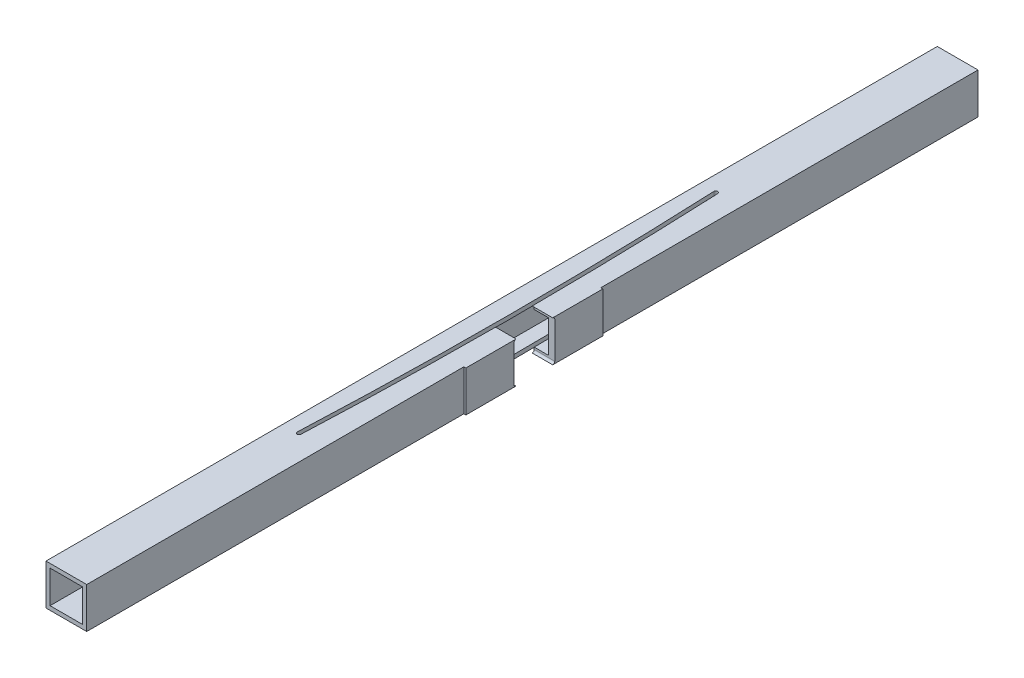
from build123d import *

# Parameters (mm, degrees)
SKETCH2_W               = 63.5
SKETCH2_H               = 63.5
SKETCH2_W_2             = 50.8
SKETCH2_H_2             = 50.8
BOSS_EXTRUDE1_DEPTH     = 695
CUT_EXTRUDE1_DEPTH      = 30.95
CUT_EXTRUDE3_DEPTH      = 697.448939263
CUT_EXTRUDE3_DEPTH_BACK = 697.448939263
BOSS_EXTRUDE7_DEPTH     = 3.175
SKETCH16_R              = 3.175
CUT_EXTRUDE4_DEPTH      = 6.35


with BuildPart() as part:
    # Sketch2 → Boss-Extrude1 (new, symmetric)
    with BuildSketch(Plane.XY):
        Rectangle(SKETCH2_W, SKETCH2_H)
        Rectangle(SKETCH2_W_2, SKETCH2_H_2, mode=Mode.SUBTRACT)
    extrude(amount=BOSS_EXTRUDE1_DEPTH, both=True)

    # Sketch4 → Cut-Extrude1 (cut)
    with BuildSketch(Plane(origin=(31.75, 0, 0), x_dir=(0, 0, -1), z_dir=(1, 0, 0))):
        with BuildLine():
            Line((-28.575, -31.75), (28.575, -31.75))
            ThreePointArc((28.575, -31.75), (30.82006403, -30.82006403), (31.75, -28.575))
            Line((31.75, -28.575), (31.75, 28.575))
            ThreePointArc((31.75, 28.575), (30.82006403, 30.82006403), (28.575, 31.75))
            Line((28.575, 31.75), (-28.575, 31.75))
            ThreePointArc((-28.575, 31.75), (-30.82006403, 30.82006403), (-31.75, 28.575))
            Line((-31.75, 28.575), (-31.75, -28.575))
            ThreePointArc((-31.75, -28.575), (-30.82006403, -30.82006403), (-28.575, -31.75))
        make_face()
    extrude(amount=-CUT_EXTRUDE1_DEPTH, mode=Mode.SUBTRACT)

    # Sketch13 → Cut-Extrude3 (cut, two sides: drawn at the far end of the back side and taken through both)
    with BuildSketch(Plane(origin=(0, 0, 0), x_dir=(1, 0, 0), z_dir=(0, 1, 0)).offset(-CUT_EXTRUDE3_DEPTH_BACK)):
        with BuildLine():
            ThreePointArc((-4.202943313, -325.132857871), (3, 0), (-4.202943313, 325.132857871))
            ThreePointArc((-4.202943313, 325.132857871), (-7.332857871, 327.997056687), (-10.197056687, 324.867142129))
            ThreePointArc((-10.197056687, 324.867142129), (-3, 0), (-10.197056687, -324.867142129))
            ThreePointArc((-10.197056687, -324.867142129), (-7.332857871, -327.997056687), (-4.202943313, -325.132857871))
        make_face()
    extrude(amount=CUT_EXTRUDE3_DEPTH + CUT_EXTRUDE3_DEPTH_BACK, mode=Mode.SUBTRACT)

    # Sketch15 → Boss-Extrude7 (add, symmetric)
    with BuildSketch(Plane(origin=(31.75, 0, 0), x_dir=(0, 0, -1), z_dir=(1, 0, 0))):
        with BuildLine():
            Line((-106.75, -31.75), (-106.75, 31.75))
            Line((-106.75, 31.75), (-28.575, 31.75))
            ThreePointArc((-28.575, 31.75), (-30.82006403, 30.82006403), (-31.75, 28.575))
            Line((-31.75, 28.575), (-31.75, -28.575))
            ThreePointArc((-31.75, -28.575), (-30.82006403, -30.82006403), (-28.575, -31.75))
            Line((-28.575, -31.75), (-106.75, -31.75))
        make_face()
    boss_extrude7 = extrude(amount=BOSS_EXTRUDE7_DEPTH, both=True)

    # Mirror3: Boss-Extrude7 across plane
    add(boss_extrude7.mirror(Plane.XY))

    # Sketch16 → Cut-Extrude4 (cut)
    with BuildSketch(Plane.XZ.offset(31.75)):
        with Locations(Location((19.925, 50, 0), (0, 0, 270))):
            Circle(SKETCH16_R)
    extrude(amount=-CUT_EXTRUDE4_DEPTH, mode=Mode.SUBTRACT)


solid = part.part
